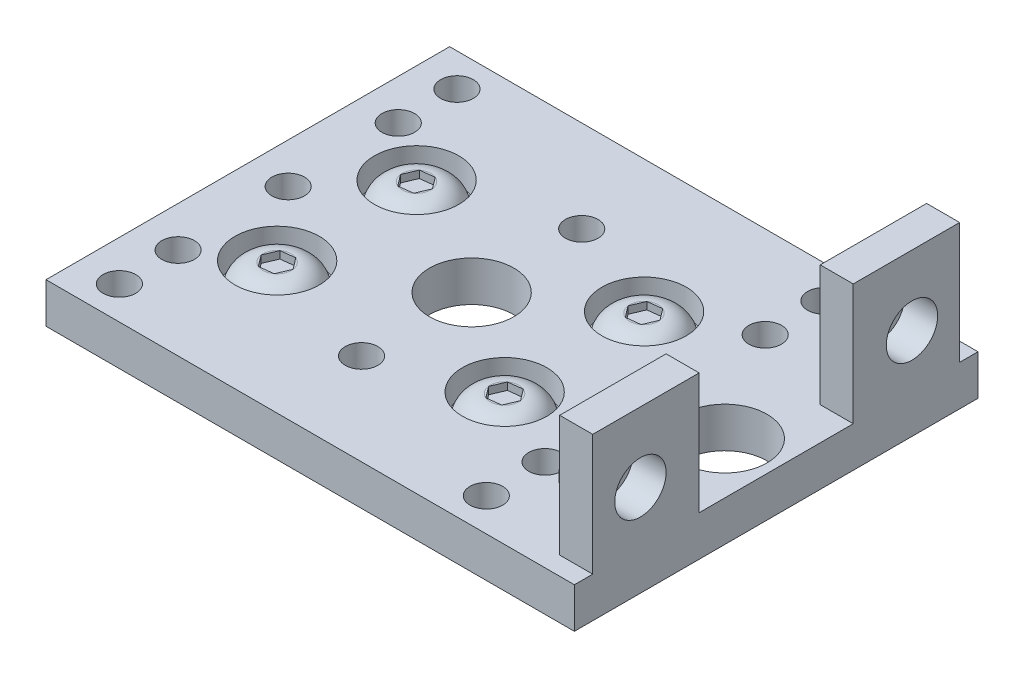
from build123d import *

# Parameters (mm, degrees)
SKETCH3_W                 = 36.576
SKETCH3_H                 = 27.94
BASE_DEPTH                = 2.794
SKETCH5_W                 = 2.286
SKETCH5_H                 = 7.366
TABS_DEPTH                = 11.176
SKETCH6_R                 = 1.778
TAB_HOLES_DEPTH           = 48.364019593
F_4_40_TAPPED_HOLE1_D     = 2.2606
F_4_40_TAPPED_HOLE1_DEPTH = 7.62
F_4_40_TAPPED_HOLE1_TIP   = 0.679152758
SKETCH9_R                 = 2.921
COUNTER_DEPTH             = 1.778
SKETCH10_R                = 1.524
THRU_DEPTH                = 48.134626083
SKETCH11_R                = 2.921
THRU_2_DEPTH              = 47.783600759
SCREW_HEAD_DEPTH          = 0.508
LPATTERN1_COUNT           = 2
LPATTERN1_PITCH           = 9.652
LPATTERN1_COUNT_DIR2      = 2
LPATTERN1_PITCH_DIR2      = 15.748
V_SCREW_HEAD_DEPTH        = 0.508
LPATTERN2_COUNT           = 2
LPATTERN2_PITCH           = 18.796


with BuildPart() as part:
    # Sketch3 → Base (new body)
    with BuildSketch(Plane(origin=(0, 0, 0), x_dir=(1, 0, 0), z_dir=(0, 1, 0))):
        with Locations((18.288, 13.97)):
            Rectangle(SKETCH3_W, SKETCH3_H)
    extrude(amount=BASE_DEPTH)

    # Sketch5 → Tabs (add)
    with BuildSketch(Plane(origin=(0, 0, 0), x_dir=(1, 0, 0), z_dir=(0, 1, 0))):
        with Locations((35.433, 22.987)):
            Rectangle(SKETCH5_W, SKETCH5_H)
        with Locations((35.433, 4.953)):
            Rectangle(SKETCH5_W, SKETCH5_H)
    extrude(amount=TABS_DEPTH)

    # Sketch6 → Tab Holes (cut, through all)
    with BuildSketch(Plane(origin=(36.576, 0, 0), x_dir=(0, 0, -1), z_dir=(1, 0, 0))):
        with Locations((4.572, 6.35)):
            Circle(SKETCH6_R)
        with Locations((23.368, 6.35)):
            Circle(SKETCH6_R)
    extrude(amount=-TAB_HOLES_DEPTH, mode=Mode.SUBTRACT)

    # 4-40 Tapped Hole1
    with Locations(Plane(origin=(2.794, 2.794, -25.654), x_dir=(0, 0, 1), z_dir=(0, 1, 0))):
        with Locations((0, 0), (0, 25.4), (4.064, 25.4), (4.064, 0), (4.064, 12.7), (19.304, 12.7), (11.684, 0), (11.684, 25.4), (19.304, 25.4), (23.368, 25.4), (19.304, 0), (23.368, 0)):
            Hole(F_4_40_TAPPED_HOLE1_D / 2, depth=F_4_40_TAPPED_HOLE1_DEPTH)
            with Locations((0, 0, -(F_4_40_TAPPED_HOLE1_DEPTH + F_4_40_TAPPED_HOLE1_TIP / 2))):  # 118° drill point
                Cone(0, F_4_40_TAPPED_HOLE1_D / 2, F_4_40_TAPPED_HOLE1_TIP, mode=Mode.SUBTRACT)

    # Sketch9 → Counter (cut)
    with BuildSketch(Plane(origin=(0, 2.794, 0), x_dir=(1, 0, 0), z_dir=(0, 1, 0))):
        with Locations(Location((6.858, 18.796, 0), (0, 0, 270))):
            Circle(SKETCH9_R)
        with Locations(Location((22.606, 18.796, 0), (0, 0, 270))):
            Circle(SKETCH9_R)
        with Locations(Location((22.606, 9.144, 0), (0, 0, 270))):
            Circle(SKETCH9_R)
        with Locations(Location((6.858, 9.144, 0), (0, 0, 270))):
            Circle(SKETCH9_R)
    extrude(amount=-COUNTER_DEPTH, mode=Mode.SUBTRACT)

    # Sketch10 → Thru (cut, through all)
    with BuildSketch(Plane(origin=(0, 1.016, 0), x_dir=(1, 0, 0), z_dir=(0, 1, 0))):
        with Locations(Location((6.858, 18.796, 0), (0, 0, 270))):
            Circle(SKETCH10_R)
        with Locations(Location((22.606, 18.796, 0), (0, 0, 270))):
            Circle(SKETCH10_R)
        with Locations(Location((22.606, 9.144, 0), (0, 0, 270))):
            Circle(SKETCH10_R)
        with Locations(Location((6.858, 9.144, 0), (0, 0, 270))):
            Circle(SKETCH10_R)
    extrude(amount=-THRU_DEPTH, mode=Mode.SUBTRACT)

    # Sketch11 → Thru 2 (cut, through all)
    with BuildSketch(Plane(origin=(0, 2.794, 0), x_dir=(1, 0, 0), z_dir=(0, 1, 0))):
        with Locations(Location((15.494, 13.97, 0), (0, 0, 270))):
            Circle(SKETCH11_R)
        with Locations(Location((33.02, 13.97, 0), (0, 0, 270))):
            Circle(SKETCH11_R)
    extrude(amount=-THRU_2_DEPTH, mode=Mode.SUBTRACT)

    # Sketch13 → Screw (revolve)
    with BuildSketch(Plane.XY.offset(-9.144), mode=Mode.PRIVATE) as screw_sk:
        with BuildLine():
            Line((4.1783, 1.016), (6.85165, 1.016))
            Line((6.85165, 1.016), (6.85165, 2.698255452))
            Line((6.85165, 2.698255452), (5.860555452, 2.698255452))
            ThreePointArc((5.860555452, 2.698255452), (4.671021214, 2.205534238), (4.1783, 1.016))
        make_face()
    screw = revolve(screw_sk.sketch.rotate(Axis((6.85165, 1.016, -9.144), (0, 1, 0)), 270), axis=Axis((6.85165, 1.016, -9.144), (0, 1, 0)))

    # Sketch14 → Screw Head (cut)
    with BuildSketch(Plane(origin=(0, 2.698255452, 0), x_dir=(1, 0, 0), z_dir=(0, 1, 0))):
        Polygon((7.238546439, 10.056457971), (6.254886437, 9.935291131), (5.867989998, 9.02283316), (6.464753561, 8.231542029), (7.448413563, 8.352708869), (7.835310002, 9.26516684), align=None)
    screw_head = extrude(amount=-SCREW_HEAD_DEPTH, mode=Mode.SUBTRACT)

    # LPattern1: Screw, Screw Head 2 × 2
    with Locations(*[(j * LPATTERN1_PITCH_DIR2, 0, -i * LPATTERN1_PITCH) for i in range(LPATTERN1_COUNT) for j in range(LPATTERN1_COUNT_DIR2) if (i, j) != (0, 0)]):
        add(screw)
        add(screw_head, mode=Mode.SUBTRACT)

    # Sketch17 → Vert Screw (revolve)
    with BuildSketch(Plane(origin=(0, 6.35, 0), x_dir=(-1, 0, 0), z_dir=(0, 1, 0)), mode=Mode.PRIVATE) as vert_screw_sk:
        with BuildLine():
            Line((-34.29, -1.89865), (-34.29, -4.572))
            Line((-34.29, -4.572), (-32.607744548, -4.572))
            Line((-32.607744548, -4.572), (-32.607744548, -3.580905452))
            ThreePointArc((-32.607744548, -3.580905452), (-33.100465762, -2.391371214), (-34.29, -1.89865))
        make_face()
    vert_screw = revolve(vert_screw_sk.sketch.rotate(Axis((34.29, 6.35, -4.572), (-1, 0, 0)), 180), axis=Axis((34.29, 6.35, -4.572), (-1, 0, 0)))

    # Sketch18 → V Screw Head (cut)
    with BuildSketch(Plane.ZY.offset(-32.607744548)):
        Polygon((-4.112012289, 7.227883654), (-5.10227569, 7.18730287), (-5.562263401, 6.309419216), (-5.031987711, 5.472116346), (-4.04172431, 5.51269713), (-3.581736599, 6.390580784), align=None)
    v_screw_head = extrude(amount=-V_SCREW_HEAD_DEPTH, mode=Mode.SUBTRACT)

    # LPattern2: Vert Screw, V Screw Head ×2
    with Locations(*[(0, 0, -i * LPATTERN2_PITCH) for i in range(1, LPATTERN2_COUNT)]):
        add(vert_screw)
        add(v_screw_head, mode=Mode.SUBTRACT)


solid = part.part
